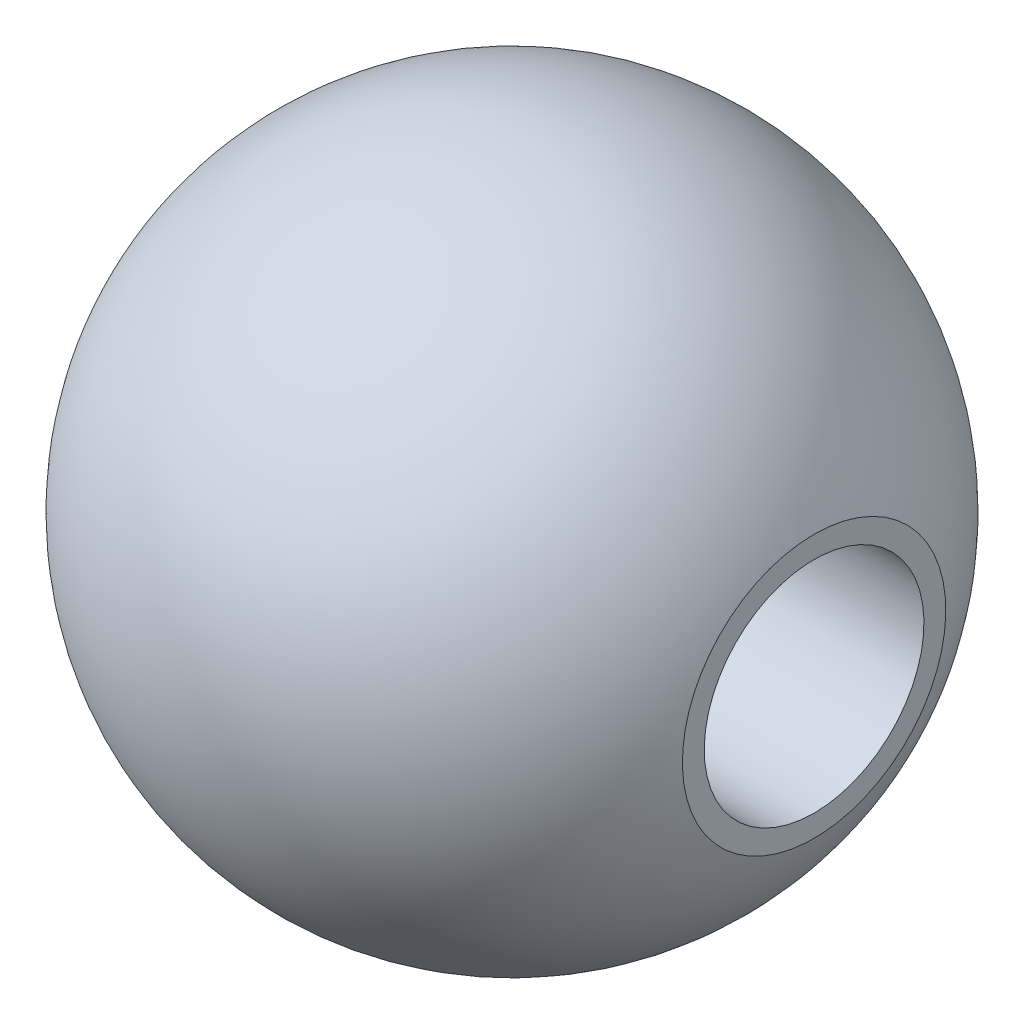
from build123d import *


with BuildPart() as part:
    # Sketch2 → Revolve2 (revolve)
    with BuildSketch(Plane.XY):
        with BuildLine():
            Line((-5.5, 0), (5.5, 0))
            Line((5.5, 0), (5.5, 2.397915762))
            ThreePointArc((5.5, 2.397915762), (0, 6), (-5.5, 2.397915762))
            Line((-5.5, 2.397915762), (-5.5, 0))
        make_face()
    revolve(axis=Axis((-5.5, 0, 0), (1, 0, 0)))

    # Sketch3 → Cut-Revolve1 (revolve, cut)
    with BuildSketch(Plane.XY, mode=Mode.PRIVATE) as cut_revolve1_sk:
        Polygon((-5.5, 0), (5.5, 0), (5.5, 2), (-4.5, 2), (-5.5, 3), align=None)
    revolve(cut_revolve1_sk.sketch.rotate(Axis((-5.5, 0, 0), (1, 0, 0)), 180), axis=Axis((-5.5, 0, 0), (1, 0, 0)), mode=Mode.SUBTRACT)


solid = part.part
